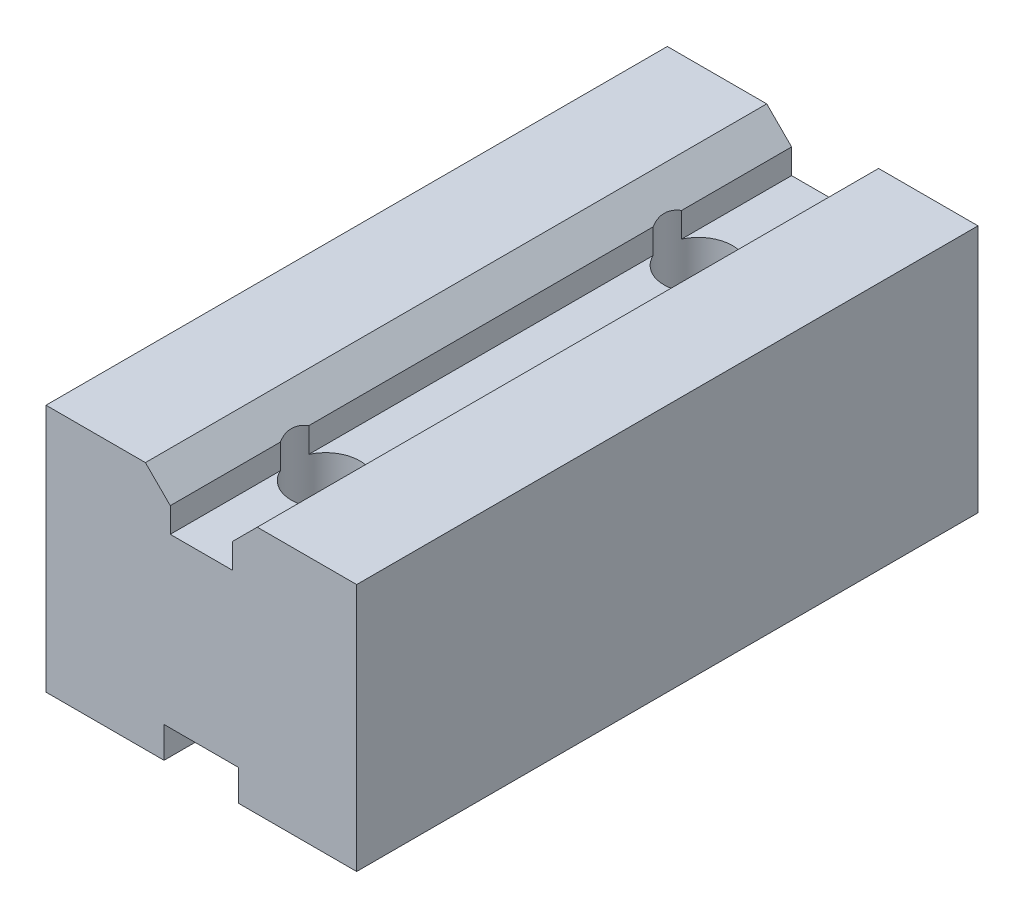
ISO-10303-21;
HEADER;
FILE_DESCRIPTION(('STEP AP214'),'2;1');
FILE_NAME('part.step','',(''),(''),'','','');
FILE_SCHEMA(('AUTOMOTIVE_DESIGN { 1 0 10303 214 1 1 1 1 }'));
ENDSEC;
DATA;
#1=APPLICATION_CONTEXT('core data for automotive mechanical design processes');
#2=APPLICATION_PROTOCOL_DEFINITION('international standard','automotive_design',2000,#1);
#3=PRODUCT_CONTEXT('',#1,'mechanical');
#4=PRODUCT('Part','Part','',(#3));
#5=PRODUCT_RELATED_PRODUCT_CATEGORY('part','',(#4));
#6=PRODUCT_DEFINITION_FORMATION('','',#4);
#7=PRODUCT_DEFINITION_CONTEXT('part definition',#1,'design');
#8=PRODUCT_DEFINITION('design','',#6,#7);
#9=PRODUCT_DEFINITION_SHAPE('','',#8);
#10=(LENGTH_UNIT() NAMED_UNIT(*) SI_UNIT(.MILLI.,.METRE.));
#11=(NAMED_UNIT(*) PLANE_ANGLE_UNIT() SI_UNIT($,.RADIAN.));
#12=(NAMED_UNIT(*) SI_UNIT($,.STERADIAN.) SOLID_ANGLE_UNIT());
#13=UNCERTAINTY_MEASURE_WITH_UNIT(LENGTH_MEASURE(1.E-05),#10,'distance_accuracy_value','');
#14=(GEOMETRIC_REPRESENTATION_CONTEXT(3) GLOBAL_UNCERTAINTY_ASSIGNED_CONTEXT((#13)) GLOBAL_UNIT_ASSIGNED_CONTEXT((#10,
#11,#12)) REPRESENTATION_CONTEXT('',''));
#15=CARTESIAN_POINT('',(0.,0.,0.));
#16=DIRECTION('',(0.,0.,1.));
#17=DIRECTION('',(1.,0.,0.));
#18=AXIS2_PLACEMENT_3D('',#15,#16,#17);
#19=CARTESIAN_POINT('',(2.5,4.53219844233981,25.));
#20=DIRECTION('',(1.,0.,0.));
#21=DIRECTION('',(0.,1.,0.));
#22=AXIS2_PLACEMENT_3D('',#19,#20,#21);
#23=PLANE('',#22);
#24=DIRECTION('',(0.,0.,-1.));
#25=VECTOR('',#24,1.);
#26=CARTESIAN_POINT('',(2.5,2.53219844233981,25.));
#27=LINE('',#26,#25);
#28=CARTESIAN_POINT('',(2.5,2.53219844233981,-16.145643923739));
#29=VERTEX_POINT('',#28);
#30=CARTESIAN_POINT('',(2.5,2.53219844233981,-25.));
#31=VERTEX_POINT('',#30);
#32=EDGE_CURVE('E352',#29,#31,#27,.T.);
#33=ORIENTED_EDGE('',*,*,#32,.F.);
#34=DIRECTION('',(0.,1.,0.));
#35=VECTOR('',#34,1.);
#36=CARTESIAN_POINT('',(2.5,6.53219844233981,-16.145643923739));
#37=LINE('',#36,#35);
#38=CARTESIAN_POINT('',(2.5,4.53219844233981,-16.145643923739));
#39=VERTEX_POINT('',#38);
#40=EDGE_CURVE('E199',#29,#39,#37,.T.);
#41=ORIENTED_EDGE('',*,*,#40,.T.);
#42=DIRECTION('',(0.,0.,-1.));
#43=VECTOR('',#42,1.);
#44=CARTESIAN_POINT('',(2.5,4.53219844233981,25.));
#45=LINE('',#44,#43);
#46=CARTESIAN_POINT('',(2.5,4.53219844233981,-25.));
#47=VERTEX_POINT('',#46);
#48=EDGE_CURVE('E350',#39,#47,#45,.T.);
#49=ORIENTED_EDGE('',*,*,#48,.T.);
#50=DIRECTION('',(0.,-1.,0.));
#51=VECTOR('',#50,1.);
#52=CARTESIAN_POINT('',(2.5,4.53219844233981,-25.));
#53=LINE('',#52,#51);
#54=EDGE_CURVE('E298',#47,#31,#53,.T.);
#55=ORIENTED_EDGE('',*,*,#54,.T.);
#56=EDGE_LOOP('',(#33,#41,#49,#55));
#57=FACE_BOUND('',#56,.T.);
#58=ADVANCED_FACE('F39',(#57),#23,.F.);
#59=CARTESIAN_POINT('',(-2.5,2.53219844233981,25.));
#60=DIRECTION('',(0.,-1.,0.));
#61=DIRECTION('',(0.,0.,-1.));
#62=AXIS2_PLACEMENT_3D('',#59,#60,#61);
#63=PLANE('',#62);
#64=CARTESIAN_POINT('',(2.5,2.53219844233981,13.854356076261));
#65=VERTEX_POINT('',#64);
#66=CARTESIAN_POINT('',(2.5,2.53219844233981,-13.854356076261));
#67=VERTEX_POINT('',#66);
#68=EDGE_CURVE('E351',#65,#67,#27,.T.);
#69=ORIENTED_EDGE('',*,*,#68,.T.);
#70=CARTESIAN_POINT('',(0.,2.53219844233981,-15.));
#71=DIRECTION('',(0.,-1.,0.));
#72=DIRECTION('',(0.,0.,-1.));
#73=AXIS2_PLACEMENT_3D('',#70,#71,#72);
#74=CIRCLE('',#73,2.75);
#75=CARTESIAN_POINT('',(-2.5,2.53219844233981,-13.854356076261));
#76=VERTEX_POINT('',#75);
#77=EDGE_CURVE('E397',#67,#76,#74,.T.);
#78=ORIENTED_EDGE('',*,*,#77,.T.);
#79=DIRECTION('',(0.,0.,-1.));
#80=VECTOR('',#79,1.);
#81=CARTESIAN_POINT('',(-2.5,2.53219844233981,25.));
#82=LINE('',#81,#80);
#83=CARTESIAN_POINT('',(-2.5,2.53219844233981,13.854356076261));
#84=VERTEX_POINT('',#83);
#85=EDGE_CURVE('E198',#84,#76,#82,.T.);
#86=ORIENTED_EDGE('',*,*,#85,.F.);
#87=CARTESIAN_POINT('',(0.,2.53219844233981,15.));
#88=DIRECTION('',(0.,-1.,0.));
#89=DIRECTION('',(0.,0.,-1.));
#90=AXIS2_PLACEMENT_3D('',#87,#88,#89);
#91=CIRCLE('',#90,2.75);
#92=EDGE_CURVE('E239',#84,#65,#91,.T.);
#93=ORIENTED_EDGE('',*,*,#92,.T.);
#94=EDGE_LOOP('',(#69,#78,#86,#93));
#95=FACE_BOUND('',#94,.T.);
#96=ADVANCED_FACE('F581',(#95),#63,.F.);
#97=CARTESIAN_POINT('',(-2.5,4.53219844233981,25.));
#98=DIRECTION('',(-1.,0.,0.));
#99=DIRECTION('',(0.,-1.,0.));
#100=AXIS2_PLACEMENT_3D('',#97,#98,#99);
#101=PLANE('',#100);
#102=ORIENTED_EDGE('',*,*,#85,.T.);
#103=DIRECTION('',(0.,1.,0.));
#104=VECTOR('',#103,1.);
#105=CARTESIAN_POINT('',(-2.5,6.53219844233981,-13.854356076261));
#106=LINE('',#105,#104);
#107=CARTESIAN_POINT('',(-2.5,4.53219844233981,-13.854356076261));
#108=VERTEX_POINT('',#107);
#109=EDGE_CURVE('E186',#76,#108,#106,.T.);
#110=ORIENTED_EDGE('',*,*,#109,.T.);
#111=DIRECTION('',(0.,0.,-1.));
#112=VECTOR('',#111,1.);
#113=CARTESIAN_POINT('',(-2.5,4.53219844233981,25.));
#114=LINE('',#113,#112);
#115=CARTESIAN_POINT('',(-2.5,4.53219844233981,13.854356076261));
#116=VERTEX_POINT('',#115);
#117=EDGE_CURVE('E196',#116,#108,#114,.T.);
#118=ORIENTED_EDGE('',*,*,#117,.F.);
#119=DIRECTION('',(0.,1.,0.));
#120=VECTOR('',#119,1.);
#121=CARTESIAN_POINT('',(-2.5,6.53219844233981,13.854356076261));
#122=LINE('',#121,#120);
#123=EDGE_CURVE('E246',#116,#84,#122,.F.);
#124=ORIENTED_EDGE('',*,*,#123,.T.);
#125=EDGE_LOOP('',(#102,#110,#118,#124));
#126=FACE_BOUND('',#125,.T.);
#127=ADVANCED_FACE('F194',(#126),#101,.F.);
#128=CARTESIAN_POINT('',(-2.5,2.53219844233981,25.));
#129=VERTEX_POINT('',#128);
#130=CARTESIAN_POINT('',(-2.5,2.53219844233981,16.145643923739));
#131=VERTEX_POINT('',#130);
#132=EDGE_CURVE('E216',#129,#131,#82,.T.);
#133=ORIENTED_EDGE('',*,*,#132,.T.);
#134=DIRECTION('',(0.,1.,0.));
#135=VECTOR('',#134,1.);
#136=CARTESIAN_POINT('',(-2.5,6.53219844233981,16.145643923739));
#137=LINE('',#136,#135);
#138=CARTESIAN_POINT('',(-2.5,4.53219844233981,16.145643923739));
#139=VERTEX_POINT('',#138);
#140=EDGE_CURVE('E238',#131,#139,#137,.T.);
#141=ORIENTED_EDGE('',*,*,#140,.T.);
#142=CARTESIAN_POINT('',(-2.5,4.53219844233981,25.));
#143=VERTEX_POINT('',#142);
#144=EDGE_CURVE('E206',#143,#139,#114,.T.);
#145=ORIENTED_EDGE('',*,*,#144,.F.);
#146=DIRECTION('',(0.,1.,0.));
#147=VECTOR('',#146,1.);
#148=CARTESIAN_POINT('',(-2.5,4.53219844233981,25.));
#149=LINE('',#148,#147);
#150=EDGE_CURVE('E334',#129,#143,#149,.T.);
#151=ORIENTED_EDGE('',*,*,#150,.F.);
#152=EDGE_LOOP('',(#133,#141,#145,#151));
#153=FACE_BOUND('',#152,.T.);
#154=ADVANCED_FACE('F425',(#153),#101,.F.);
#155=CARTESIAN_POINT('',(2.5,2.53219844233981,25.));
#156=VERTEX_POINT('',#155);
#157=CARTESIAN_POINT('',(2.5,2.53219844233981,16.145643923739));
#158=VERTEX_POINT('',#157);
#159=EDGE_CURVE('E346',#156,#158,#27,.T.);
#160=ORIENTED_EDGE('',*,*,#159,.T.);
#161=EDGE_CURVE('E61',#158,#131,#91,.T.);
#162=ORIENTED_EDGE('',*,*,#161,.T.);
#163=ORIENTED_EDGE('',*,*,#132,.F.);
#164=DIRECTION('',(-1.,0.,0.));
#165=VECTOR('',#164,1.);
#166=CARTESIAN_POINT('',(-2.5,2.53219844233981,25.));
#167=LINE('',#166,#165);
#168=EDGE_CURVE('E338',#156,#129,#167,.T.);
#169=ORIENTED_EDGE('',*,*,#168,.F.);
#170=EDGE_LOOP('',(#160,#162,#163,#169));
#171=FACE_BOUND('',#170,.T.);
#172=ADVANCED_FACE('F436',(#171),#63,.F.);
#173=CARTESIAN_POINT('',(2.5,4.53219844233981,13.854356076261));
#174=VERTEX_POINT('',#173);
#175=CARTESIAN_POINT('',(2.5,4.53219844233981,-13.854356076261));
#176=VERTEX_POINT('',#175);
#177=EDGE_CURVE('E359',#174,#176,#45,.T.);
#178=ORIENTED_EDGE('',*,*,#177,.T.);
#179=DIRECTION('',(0.,1.,0.));
#180=VECTOR('',#179,1.);
#181=CARTESIAN_POINT('',(2.5,6.53219844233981,-13.854356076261));
#182=LINE('',#181,#180);
#183=EDGE_CURVE('E401',#176,#67,#182,.F.);
#184=ORIENTED_EDGE('',*,*,#183,.T.);
#185=ORIENTED_EDGE('',*,*,#68,.F.);
#186=DIRECTION('',(0.,1.,0.));
#187=VECTOR('',#186,1.);
#188=CARTESIAN_POINT('',(2.5,6.53219844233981,13.854356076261));
#189=LINE('',#188,#187);
#190=EDGE_CURVE('E47',#65,#174,#189,.T.);
#191=ORIENTED_EDGE('',*,*,#190,.T.);
#192=EDGE_LOOP('',(#178,#184,#185,#191));
#193=FACE_BOUND('',#192,.T.);
#194=ADVANCED_FACE('F478',(#193),#23,.F.);
#195=CARTESIAN_POINT('',(12.5,-13.4678015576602,25.));
#196=DIRECTION('',(0.,1.,0.));
#197=DIRECTION('',(0.,0.,1.));
#198=AXIS2_PLACEMENT_3D('',#195,#196,#197);
#199=PLANE('',#198);
#200=DIRECTION('',(1.,0.,0.));
#201=VECTOR('',#200,1.);
#202=CARTESIAN_POINT('',(12.5,-13.4678015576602,-25.));
#203=LINE('',#202,#201);
#204=CARTESIAN_POINT('',(-12.5,-13.4678015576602,-25.));
#205=VERTEX_POINT('',#204);
#206=CARTESIAN_POINT('',(-3.,-13.4678015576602,-25.));
#207=VERTEX_POINT('',#206);
#208=EDGE_CURVE('E272',#205,#207,#203,.T.);
#209=ORIENTED_EDGE('',*,*,#208,.T.);
#210=DIRECTION('',(0.,0.,1.));
#211=VECTOR('',#210,1.);
#212=CARTESIAN_POINT('',(-3.,-13.4678015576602,-25.));
#213=LINE('',#212,#211);
#214=CARTESIAN_POINT('',(-3.,-13.4678015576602,25.));
#215=VERTEX_POINT('',#214);
#216=EDGE_CURVE('E771',#207,#215,#213,.T.);
#217=ORIENTED_EDGE('',*,*,#216,.T.);
#218=DIRECTION('',(1.,0.,0.));
#219=VECTOR('',#218,1.);
#220=CARTESIAN_POINT('',(12.5,-13.4678015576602,25.));
#221=LINE('',#220,#219);
#222=CARTESIAN_POINT('',(-12.5,-13.4678015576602,25.));
#223=VERTEX_POINT('',#222);
#224=EDGE_CURVE('E458',#223,#215,#221,.T.);
#225=ORIENTED_EDGE('',*,*,#224,.F.);
#226=DIRECTION('',(0.,0.,-1.));
#227=VECTOR('',#226,1.);
#228=CARTESIAN_POINT('',(-12.5,-13.4678015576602,25.));
#229=LINE('',#228,#227);
#230=EDGE_CURVE('E368',#223,#205,#229,.T.);
#231=ORIENTED_EDGE('',*,*,#230,.T.);
#232=EDGE_LOOP('',(#209,#217,#225,#231));
#233=FACE_BOUND('',#232,.T.);
#234=ADVANCED_FACE('F617',(#233),#199,.F.);
#235=CARTESIAN_POINT('',(-12.5,-13.4678015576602,25.));
#236=DIRECTION('',(1.,0.,0.));
#237=DIRECTION('',(0.,1.,0.));
#238=AXIS2_PLACEMENT_3D('',#235,#236,#237);
#239=PLANE('',#238);
#240=DIRECTION('',(0.,-1.,0.));
#241=VECTOR('',#240,1.);
#242=CARTESIAN_POINT('',(-12.5,-13.4678015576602,-25.));
#243=LINE('',#242,#241);
#244=CARTESIAN_POINT('',(-12.5,6.53219844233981,-25.));
#245=VERTEX_POINT('',#244);
#246=EDGE_CURVE('E279',#245,#205,#243,.T.);
#247=ORIENTED_EDGE('',*,*,#246,.T.);
#248=ORIENTED_EDGE('',*,*,#230,.F.);
#249=DIRECTION('',(0.,-1.,0.));
#250=VECTOR('',#249,1.);
#251=CARTESIAN_POINT('',(-12.5,-13.4678015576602,25.));
#252=LINE('',#251,#250);
#253=CARTESIAN_POINT('',(-12.5,6.53219844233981,25.));
#254=VERTEX_POINT('',#253);
#255=EDGE_CURVE('E320',#254,#223,#252,.T.);
#256=ORIENTED_EDGE('',*,*,#255,.F.);
#257=DIRECTION('',(0.,0.,-1.));
#258=VECTOR('',#257,1.);
#259=CARTESIAN_POINT('',(-12.5,6.53219844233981,25.));
#260=LINE('',#259,#258);
#261=EDGE_CURVE('E321',#254,#245,#260,.T.);
#262=ORIENTED_EDGE('',*,*,#261,.T.);
#263=EDGE_LOOP('',(#247,#248,#256,#262));
#264=FACE_BOUND('',#263,.T.);
#265=ADVANCED_FACE('F41',(#264),#239,.F.);
#266=CARTESIAN_POINT('',(3.,-13.4678015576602,25.));
#267=VERTEX_POINT('',#266);
#268=CARTESIAN_POINT('',(12.5,-13.4678015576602,25.));
#269=VERTEX_POINT('',#268);
#270=EDGE_CURVE('E456',#267,#269,#221,.T.);
#271=ORIENTED_EDGE('',*,*,#270,.F.);
#272=DIRECTION('',(0.,0.,1.));
#273=VECTOR('',#272,1.);
#274=CARTESIAN_POINT('',(3.,-13.4678015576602,-25.));
#275=LINE('',#274,#273);
#276=CARTESIAN_POINT('',(3.,-13.4678015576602,-25.));
#277=VERTEX_POINT('',#276);
#278=EDGE_CURVE('E461',#277,#267,#275,.T.);
#279=ORIENTED_EDGE('',*,*,#278,.F.);
#280=CARTESIAN_POINT('',(12.5,-13.4678015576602,-25.));
#281=VERTEX_POINT('',#280);
#282=EDGE_CURVE('E278',#277,#281,#203,.T.);
#283=ORIENTED_EDGE('',*,*,#282,.T.);
#284=DIRECTION('',(0.,0.,-1.));
#285=VECTOR('',#284,1.);
#286=CARTESIAN_POINT('',(12.5,-13.4678015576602,25.));
#287=LINE('',#286,#285);
#288=EDGE_CURVE('E365',#269,#281,#287,.T.);
#289=ORIENTED_EDGE('',*,*,#288,.F.);
#290=EDGE_LOOP('',(#271,#279,#283,#289));
#291=FACE_BOUND('',#290,.T.);
#292=ADVANCED_FACE('F638',(#291),#199,.F.);
#293=CARTESIAN_POINT('',(12.5,-13.4678015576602,25.));
#294=DIRECTION('',(-1.,0.,0.));
#295=DIRECTION('',(0.,-1.,0.));
#296=AXIS2_PLACEMENT_3D('',#293,#294,#295);
#297=PLANE('',#296);
#298=DIRECTION('',(0.,1.,0.));
#299=VECTOR('',#298,1.);
#300=CARTESIAN_POINT('',(12.5,-13.4678015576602,-25.));
#301=LINE('',#300,#299);
#302=CARTESIAN_POINT('',(12.5,6.53219844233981,-25.));
#303=VERTEX_POINT('',#302);
#304=EDGE_CURVE('E277',#281,#303,#301,.T.);
#305=ORIENTED_EDGE('',*,*,#304,.T.);
#306=DIRECTION('',(0.,0.,-1.));
#307=VECTOR('',#306,1.);
#308=CARTESIAN_POINT('',(12.5,6.53219844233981,25.));
#309=LINE('',#308,#307);
#310=CARTESIAN_POINT('',(12.5,6.53219844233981,25.));
#311=VERTEX_POINT('',#310);
#312=EDGE_CURVE('E362',#311,#303,#309,.T.);
#313=ORIENTED_EDGE('',*,*,#312,.F.);
#314=DIRECTION('',(0.,1.,0.));
#315=VECTOR('',#314,1.);
#316=CARTESIAN_POINT('',(12.5,-13.4678015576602,25.));
#317=LINE('',#316,#315);
#318=EDGE_CURVE('E464',#269,#311,#317,.T.);
#319=ORIENTED_EDGE('',*,*,#318,.F.);
#320=ORIENTED_EDGE('',*,*,#288,.T.);
#321=EDGE_LOOP('',(#305,#313,#319,#320));
#322=FACE_BOUND('',#321,.T.);
#323=ADVANCED_FACE('F490',(#322),#297,.F.);
#324=CARTESIAN_POINT('',(12.5,6.53219844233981,25.));
#325=DIRECTION('',(0.,-1.,0.));
#326=DIRECTION('',(0.,0.,-1.));
#327=AXIS2_PLACEMENT_3D('',#324,#325,#326);
#328=PLANE('',#327);
#329=DIRECTION('',(-1.,0.,0.));
#330=VECTOR('',#329,1.);
#331=CARTESIAN_POINT('',(12.5,6.53219844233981,-25.));
#332=LINE('',#331,#330);
#333=CARTESIAN_POINT('',(4.50000000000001,6.53219844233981,-25.));
#334=VERTEX_POINT('',#333);
#335=EDGE_CURVE('E290',#303,#334,#332,.T.);
#336=ORIENTED_EDGE('',*,*,#335,.T.);
#337=DIRECTION('',(0.,0.,-1.));
#338=VECTOR('',#337,1.);
#339=CARTESIAN_POINT('',(4.50000000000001,6.53219844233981,25.));
#340=LINE('',#339,#338);
#341=CARTESIAN_POINT('',(4.50000000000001,6.53219844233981,25.));
#342=VERTEX_POINT('',#341);
#343=EDGE_CURVE('E358',#342,#334,#340,.T.);
#344=ORIENTED_EDGE('',*,*,#343,.F.);
#345=DIRECTION('',(-1.,0.,0.));
#346=VECTOR('',#345,1.);
#347=CARTESIAN_POINT('',(12.5,6.53219844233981,25.));
#348=LINE('',#347,#346);
#349=EDGE_CURVE('E466',#311,#342,#348,.T.);
#350=ORIENTED_EDGE('',*,*,#349,.F.);
#351=ORIENTED_EDGE('',*,*,#312,.T.);
#352=EDGE_LOOP('',(#336,#344,#350,#351));
#353=FACE_BOUND('',#352,.T.);
#354=ADVANCED_FACE('F486',(#353),#328,.F.);
#355=CARTESIAN_POINT('',(4.50000000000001,6.53219844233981,25.));
#356=DIRECTION('',(0.707106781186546,-0.707106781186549,0.));
#357=DIRECTION('',(0.707106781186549,0.707106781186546,0.));
#358=AXIS2_PLACEMENT_3D('',#355,#356,#357);
#359=PLANE('',#358);
#360=ORIENTED_EDGE('',*,*,#48,.F.);
#361=CARTESIAN_POINT('',(0.,2.03219844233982,-15.));
#362=DIRECTION('',(0.707106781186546,-0.707106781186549,0.));
#363=DIRECTION('',(0.707106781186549,0.707106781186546,0.));
#364=AXIS2_PLACEMENT_3D('',#361,#362,#363);
#365=ELLIPSE('',#364,3.889087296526,2.75);
#366=EDGE_CURVE('E403',#39,#176,#365,.T.);
#367=ORIENTED_EDGE('',*,*,#366,.T.);
#368=ORIENTED_EDGE('',*,*,#177,.F.);
#369=CARTESIAN_POINT('',(0.,2.03219844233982,15.));
#370=DIRECTION('',(0.707106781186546,-0.707106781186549,0.));
#371=DIRECTION('',(0.707106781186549,0.707106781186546,0.));
#372=AXIS2_PLACEMENT_3D('',#369,#370,#371);
#373=ELLIPSE('',#372,3.889087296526,2.75);
#374=CARTESIAN_POINT('',(2.5,4.53219844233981,16.145643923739));
#375=VERTEX_POINT('',#374);
#376=EDGE_CURVE('E242',#174,#375,#373,.T.);
#377=ORIENTED_EDGE('',*,*,#376,.T.);
#378=CARTESIAN_POINT('',(2.5,4.53219844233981,25.));
#379=VERTEX_POINT('',#378);
#380=EDGE_CURVE('E353',#379,#375,#45,.T.);
#381=ORIENTED_EDGE('',*,*,#380,.F.);
#382=DIRECTION('',(-0.707106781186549,-0.707106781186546,0.));
#383=VECTOR('',#382,1.);
#384=CARTESIAN_POINT('',(4.50000000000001,6.53219844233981,25.));
#385=LINE('',#384,#383);
#386=EDGE_CURVE('E467',#342,#379,#385,.T.);
#387=ORIENTED_EDGE('',*,*,#386,.F.);
#388=ORIENTED_EDGE('',*,*,#343,.T.);
#389=DIRECTION('',(-0.707106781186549,-0.707106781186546,0.));
#390=VECTOR('',#389,1.);
#391=CARTESIAN_POINT('',(4.50000000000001,6.53219844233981,-25.));
#392=LINE('',#391,#390);
#393=EDGE_CURVE('E293',#334,#47,#392,.T.);
#394=ORIENTED_EDGE('',*,*,#393,.T.);
#395=EDGE_LOOP('',(#360,#367,#368,#377,#381,#387,#388,#394));
#396=FACE_BOUND('',#395,.T.);
#397=ADVANCED_FACE('F472',(#396),#359,.F.);
#398=ORIENTED_EDGE('',*,*,#380,.T.);
#399=DIRECTION('',(0.,1.,0.));
#400=VECTOR('',#399,1.);
#401=CARTESIAN_POINT('',(2.5,6.53219844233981,16.145643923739));
#402=LINE('',#401,#400);
#403=EDGE_CURVE('E371',#375,#158,#402,.F.);
#404=ORIENTED_EDGE('',*,*,#403,.T.);
#405=ORIENTED_EDGE('',*,*,#159,.F.);
#406=DIRECTION('',(0.,-1.,0.));
#407=VECTOR('',#406,1.);
#408=CARTESIAN_POINT('',(2.5,4.53219844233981,25.));
#409=LINE('',#408,#407);
#410=EDGE_CURVE('E342',#379,#156,#409,.T.);
#411=ORIENTED_EDGE('',*,*,#410,.F.);
#412=EDGE_LOOP('',(#398,#404,#405,#411));
#413=FACE_BOUND('',#412,.T.);
#414=ADVANCED_FACE('F474',(#413),#23,.F.);
#415=CARTESIAN_POINT('',(-2.5,2.53219844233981,-16.145643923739));
#416=VERTEX_POINT('',#415);
#417=CARTESIAN_POINT('',(-2.5,2.53219844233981,-25.));
#418=VERTEX_POINT('',#417);
#419=EDGE_CURVE('E209',#416,#418,#82,.T.);
#420=ORIENTED_EDGE('',*,*,#419,.F.);
#421=EDGE_CURVE('E200',#416,#29,#74,.T.);
#422=ORIENTED_EDGE('',*,*,#421,.T.);
#423=ORIENTED_EDGE('',*,*,#32,.T.);
#424=DIRECTION('',(-1.,0.,0.));
#425=VECTOR('',#424,1.);
#426=CARTESIAN_POINT('',(-2.5,2.53219844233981,-25.));
#427=LINE('',#426,#425);
#428=EDGE_CURVE('E303',#31,#418,#427,.T.);
#429=ORIENTED_EDGE('',*,*,#428,.T.);
#430=EDGE_LOOP('',(#420,#422,#423,#429));
#431=FACE_BOUND('',#430,.T.);
#432=ADVANCED_FACE('F445',(#431),#63,.F.);
#433=CARTESIAN_POINT('',(-2.5,4.53219844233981,-16.145643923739));
#434=VERTEX_POINT('',#433);
#435=CARTESIAN_POINT('',(-2.5,4.53219844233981,-25.));
#436=VERTEX_POINT('',#435);
#437=EDGE_CURVE('E207',#434,#436,#114,.T.);
#438=ORIENTED_EDGE('',*,*,#437,.F.);
#439=DIRECTION('',(0.,1.,0.));
#440=VECTOR('',#439,1.);
#441=CARTESIAN_POINT('',(-2.5,6.53219844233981,-16.145643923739));
#442=LINE('',#441,#440);
#443=EDGE_CURVE('E54',#434,#416,#442,.F.);
#444=ORIENTED_EDGE('',*,*,#443,.T.);
#445=ORIENTED_EDGE('',*,*,#419,.T.);
#446=DIRECTION('',(0.,1.,0.));
#447=VECTOR('',#446,1.);
#448=CARTESIAN_POINT('',(-2.5,4.53219844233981,-25.));
#449=LINE('',#448,#447);
#450=EDGE_CURVE('E309',#418,#436,#449,.T.);
#451=ORIENTED_EDGE('',*,*,#450,.T.);
#452=EDGE_LOOP('',(#438,#444,#445,#451));
#453=FACE_BOUND('',#452,.T.);
#454=ADVANCED_FACE('F440',(#453),#101,.F.);
#455=CARTESIAN_POINT('',(-4.50000000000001,6.53219844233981,25.));
#456=DIRECTION('',(-0.707106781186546,-0.707106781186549,0.));
#457=DIRECTION('',(0.707106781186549,-0.707106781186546,0.));
#458=AXIS2_PLACEMENT_3D('',#455,#456,#457);
#459=PLANE('',#458);
#460=ORIENTED_EDGE('',*,*,#117,.T.);
#461=CARTESIAN_POINT('',(0.,2.03219844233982,-15.));
#462=DIRECTION('',(-0.707106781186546,-0.707106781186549,0.));
#463=DIRECTION('',(-0.707106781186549,0.707106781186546,0.));
#464=AXIS2_PLACEMENT_3D('',#461,#462,#463);
#465=ELLIPSE('',#464,3.889087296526,2.75);
#466=EDGE_CURVE('E12',#108,#434,#465,.T.);
#467=ORIENTED_EDGE('',*,*,#466,.T.);
#468=ORIENTED_EDGE('',*,*,#437,.T.);
#469=DIRECTION('',(-0.707106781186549,0.707106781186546,0.));
#470=VECTOR('',#469,1.);
#471=CARTESIAN_POINT('',(-4.50000000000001,6.53219844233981,-25.));
#472=LINE('',#471,#470);
#473=CARTESIAN_POINT('',(-4.50000000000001,6.53219844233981,-25.));
#474=VERTEX_POINT('',#473);
#475=EDGE_CURVE('E313',#436,#474,#472,.T.);
#476=ORIENTED_EDGE('',*,*,#475,.T.);
#477=DIRECTION('',(0.,0.,-1.));
#478=VECTOR('',#477,1.);
#479=CARTESIAN_POINT('',(-4.50000000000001,6.53219844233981,25.));
#480=LINE('',#479,#478);
#481=CARTESIAN_POINT('',(-4.50000000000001,6.53219844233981,25.));
#482=VERTEX_POINT('',#481);
#483=EDGE_CURVE('E211',#482,#474,#480,.T.);
#484=ORIENTED_EDGE('',*,*,#483,.F.);
#485=DIRECTION('',(-0.707106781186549,0.707106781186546,0.));
#486=VECTOR('',#485,1.);
#487=CARTESIAN_POINT('',(-4.50000000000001,6.53219844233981,25.));
#488=LINE('',#487,#486);
#489=EDGE_CURVE('E330',#143,#482,#488,.T.);
#490=ORIENTED_EDGE('',*,*,#489,.F.);
#491=ORIENTED_EDGE('',*,*,#144,.T.);
#492=CARTESIAN_POINT('',(0.,2.03219844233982,15.));
#493=DIRECTION('',(-0.707106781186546,-0.707106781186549,0.));
#494=DIRECTION('',(-0.707106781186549,0.707106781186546,0.));
#495=AXIS2_PLACEMENT_3D('',#492,#493,#494);
#496=ELLIPSE('',#495,3.889087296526,2.75);
#497=EDGE_CURVE('E205',#139,#116,#496,.T.);
#498=ORIENTED_EDGE('',*,*,#497,.T.);
#499=EDGE_LOOP('',(#460,#467,#468,#476,#484,#490,#491,#498));
#500=FACE_BOUND('',#499,.T.);
#501=ADVANCED_FACE('F203',(#500),#459,.F.);
#502=CARTESIAN_POINT('',(-12.5,6.53219844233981,25.));
#503=DIRECTION('',(0.,-1.,0.));
#504=DIRECTION('',(0.,0.,-1.));
#505=AXIS2_PLACEMENT_3D('',#502,#503,#504);
#506=PLANE('',#505);
#507=DIRECTION('',(-1.,0.,0.));
#508=VECTOR('',#507,1.);
#509=CARTESIAN_POINT('',(-12.5,6.53219844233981,-25.));
#510=LINE('',#509,#508);
#511=EDGE_CURVE('E317',#474,#245,#510,.T.);
#512=ORIENTED_EDGE('',*,*,#511,.T.);
#513=ORIENTED_EDGE('',*,*,#261,.F.);
#514=DIRECTION('',(-1.,0.,0.));
#515=VECTOR('',#514,1.);
#516=CARTESIAN_POINT('',(-12.5,6.53219844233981,25.));
#517=LINE('',#516,#515);
#518=EDGE_CURVE('E323',#482,#254,#517,.T.);
#519=ORIENTED_EDGE('',*,*,#518,.F.);
#520=ORIENTED_EDGE('',*,*,#483,.T.);
#521=EDGE_LOOP('',(#512,#513,#519,#520));
#522=FACE_BOUND('',#521,.T.);
#523=ADVANCED_FACE('F454',(#522),#506,.F.);
#524=CARTESIAN_POINT('',(0.,0.,25.));
#525=DIRECTION('',(0.,0.,-1.));
#526=DIRECTION('',(-1.,0.,0.));
#527=AXIS2_PLACEMENT_3D('',#524,#525,#526);
#528=PLANE('',#527);
#529=ORIENTED_EDGE('',*,*,#224,.T.);
#530=DIRECTION('',(0.,-1.,0.));
#531=VECTOR('',#530,1.);
#532=CARTESIAN_POINT('',(-3.,-13.4678015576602,25.));
#533=LINE('',#532,#531);
#534=CARTESIAN_POINT('',(-3.,-10.9678015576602,25.));
#535=VERTEX_POINT('',#534);
#536=EDGE_CURVE('E254',#535,#215,#533,.T.);
#537=ORIENTED_EDGE('',*,*,#536,.F.);
#538=DIRECTION('',(-1.,0.,0.));
#539=VECTOR('',#538,1.);
#540=CARTESIAN_POINT('',(-3.,-10.9678015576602,25.));
#541=LINE('',#540,#539);
#542=CARTESIAN_POINT('',(3.,-10.9678015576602,25.));
#543=VERTEX_POINT('',#542);
#544=EDGE_CURVE('E757',#543,#535,#541,.T.);
#545=ORIENTED_EDGE('',*,*,#544,.F.);
#546=DIRECTION('',(0.,1.,0.));
#547=VECTOR('',#546,1.);
#548=CARTESIAN_POINT('',(3.,-10.9678015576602,25.));
#549=LINE('',#548,#547);
#550=EDGE_CURVE('E247',#267,#543,#549,.T.);
#551=ORIENTED_EDGE('',*,*,#550,.F.);
#552=ORIENTED_EDGE('',*,*,#270,.T.);
#553=ORIENTED_EDGE('',*,*,#318,.T.);
#554=ORIENTED_EDGE('',*,*,#349,.T.);
#555=ORIENTED_EDGE('',*,*,#386,.T.);
#556=ORIENTED_EDGE('',*,*,#410,.T.);
#557=ORIENTED_EDGE('',*,*,#168,.T.);
#558=ORIENTED_EDGE('',*,*,#150,.T.);
#559=ORIENTED_EDGE('',*,*,#489,.T.);
#560=ORIENTED_EDGE('',*,*,#518,.T.);
#561=ORIENTED_EDGE('',*,*,#255,.T.);
#562=EDGE_LOOP('',(#529,#537,#545,#551,#552,#553,#554,#555,#556,#557,#558,#559,#560,#561));
#563=FACE_BOUND('',#562,.T.);
#564=ADVANCED_FACE('F431',(#563),#528,.F.);
#565=CARTESIAN_POINT('',(0.,0.,-25.));
#566=DIRECTION('',(0.,0.,-1.));
#567=DIRECTION('',(-1.,0.,0.));
#568=AXIS2_PLACEMENT_3D('',#565,#566,#567);
#569=PLANE('',#568);
#570=DIRECTION('',(0.,-1.,0.));
#571=VECTOR('',#570,1.);
#572=CARTESIAN_POINT('',(-3.,-13.4678015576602,-25.));
#573=LINE('',#572,#571);
#574=CARTESIAN_POINT('',(-3.,-10.9678015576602,-25.));
#575=VERTEX_POINT('',#574);
#576=EDGE_CURVE('E259',#575,#207,#573,.T.);
#577=ORIENTED_EDGE('',*,*,#576,.T.);
#578=ORIENTED_EDGE('',*,*,#208,.F.);
#579=ORIENTED_EDGE('',*,*,#246,.F.);
#580=ORIENTED_EDGE('',*,*,#511,.F.);
#581=ORIENTED_EDGE('',*,*,#475,.F.);
#582=ORIENTED_EDGE('',*,*,#450,.F.);
#583=ORIENTED_EDGE('',*,*,#428,.F.);
#584=ORIENTED_EDGE('',*,*,#54,.F.);
#585=ORIENTED_EDGE('',*,*,#393,.F.);
#586=ORIENTED_EDGE('',*,*,#335,.F.);
#587=ORIENTED_EDGE('',*,*,#304,.F.);
#588=ORIENTED_EDGE('',*,*,#282,.F.);
#589=DIRECTION('',(0.,1.,0.));
#590=VECTOR('',#589,1.);
#591=CARTESIAN_POINT('',(3.,-10.9678015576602,-25.));
#592=LINE('',#591,#590);
#593=CARTESIAN_POINT('',(3.,-10.9678015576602,-25.));
#594=VERTEX_POINT('',#593);
#595=EDGE_CURVE('E248',#277,#594,#592,.T.);
#596=ORIENTED_EDGE('',*,*,#595,.T.);
#597=DIRECTION('',(-1.,0.,0.));
#598=VECTOR('',#597,1.);
#599=CARTESIAN_POINT('',(-3.,-10.9678015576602,-25.));
#600=LINE('',#599,#598);
#601=EDGE_CURVE('E253',#594,#575,#600,.T.);
#602=ORIENTED_EDGE('',*,*,#601,.T.);
#603=EDGE_LOOP('',(#577,#578,#579,#580,#581,#582,#583,#584,#585,#586,#587,#588,#596,#602));
#604=FACE_BOUND('',#603,.T.);
#605=ADVANCED_FACE('F451',(#604),#569,.T.);
#606=CARTESIAN_POINT('',(-3.,-13.4678015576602,-25.));
#607=DIRECTION('',(-1.,0.,0.));
#608=DIRECTION('',(0.,-1.,0.));
#609=AXIS2_PLACEMENT_3D('',#606,#607,#608);
#610=PLANE('',#609);
#611=ORIENTED_EDGE('',*,*,#536,.T.);
#612=ORIENTED_EDGE('',*,*,#216,.F.);
#613=ORIENTED_EDGE('',*,*,#576,.F.);
#614=DIRECTION('',(0.,0.,1.));
#615=VECTOR('',#614,1.);
#616=CARTESIAN_POINT('',(-3.,-10.9678015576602,-25.));
#617=LINE('',#616,#615);
#618=EDGE_CURVE('E759',#575,#535,#617,.T.);
#619=ORIENTED_EDGE('',*,*,#618,.T.);
#620=EDGE_LOOP('',(#611,#612,#613,#619));
#621=FACE_BOUND('',#620,.T.);
#622=ADVANCED_FACE('F503',(#621),#610,.F.);
#623=CARTESIAN_POINT('',(-3.,-10.9678015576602,-25.));
#624=DIRECTION('',(0.,1.,0.));
#625=DIRECTION('',(0.,0.,1.));
#626=AXIS2_PLACEMENT_3D('',#623,#624,#625);
#627=PLANE('',#626);
#628=CARTESIAN_POINT('',(0.,-10.9678015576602,-15.));
#629=DIRECTION('',(0.,1.,0.));
#630=DIRECTION('',(0.,0.,1.));
#631=AXIS2_PLACEMENT_3D('',#628,#629,#630);
#632=CIRCLE('',#631,1.45);
#633=CARTESIAN_POINT('',(0.,-10.9678015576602,-13.55));
#634=VERTEX_POINT('',#633);
#635=EDGE_CURVE('E376',#634,#634,#632,.T.);
#636=ORIENTED_EDGE('',*,*,#635,.T.);
#637=EDGE_LOOP('',(#636));
#638=FACE_BOUND('',#637,.T.);
#639=CARTESIAN_POINT('',(0.,-10.9678015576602,15.));
#640=DIRECTION('',(0.,1.,0.));
#641=DIRECTION('',(0.,0.,1.));
#642=AXIS2_PLACEMENT_3D('',#639,#640,#641);
#643=CIRCLE('',#642,1.45);
#644=CARTESIAN_POINT('',(0.,-10.9678015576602,16.45));
#645=VERTEX_POINT('',#644);
#646=EDGE_CURVE('E233',#645,#645,#643,.T.);
#647=ORIENTED_EDGE('',*,*,#646,.T.);
#648=EDGE_LOOP('',(#647));
#649=FACE_BOUND('',#648,.T.);
#650=ORIENTED_EDGE('',*,*,#544,.T.);
#651=ORIENTED_EDGE('',*,*,#618,.F.);
#652=ORIENTED_EDGE('',*,*,#601,.F.);
#653=DIRECTION('',(0.,0.,1.));
#654=VECTOR('',#653,1.);
#655=CARTESIAN_POINT('',(3.,-10.9678015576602,-25.));
#656=LINE('',#655,#654);
#657=EDGE_CURVE('E762',#594,#543,#656,.T.);
#658=ORIENTED_EDGE('',*,*,#657,.T.);
#659=EDGE_LOOP('',(#650,#651,#652,#658));
#660=FACE_BOUND('',#659,.T.);
#661=ADVANCED_FACE('F499',(#638,#649,#660),#627,.F.);
#662=CARTESIAN_POINT('',(3.,-10.9678015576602,-25.));
#663=DIRECTION('',(1.,0.,0.));
#664=DIRECTION('',(0.,0.,-1.));
#665=AXIS2_PLACEMENT_3D('',#662,#663,#664);
#666=PLANE('',#665);
#667=ORIENTED_EDGE('',*,*,#550,.T.);
#668=ORIENTED_EDGE('',*,*,#657,.F.);
#669=ORIENTED_EDGE('',*,*,#595,.F.);
#670=ORIENTED_EDGE('',*,*,#278,.T.);
#671=EDGE_LOOP('',(#667,#668,#669,#670));
#672=FACE_BOUND('',#671,.T.);
#673=ADVANCED_FACE('F420',(#672),#666,.F.);
#674=CARTESIAN_POINT('',(0.,6.53219844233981,15.));
#675=DIRECTION('',(0.,1.,0.));
#676=DIRECTION('',(0.,0.,1.));
#677=AXIS2_PLACEMENT_3D('',#674,#675,#676);
#678=CYLINDRICAL_SURFACE('',#677,2.75);
#679=CARTESIAN_POINT('',(0.,-3.46780155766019,15.));
#680=DIRECTION('',(0.,1.,0.));
#681=DIRECTION('',(0.,0.,1.));
#682=AXIS2_PLACEMENT_3D('',#679,#680,#681);
#683=CIRCLE('',#682,2.75);
#684=CARTESIAN_POINT('',(0.,-3.46780155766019,17.75));
#685=VERTEX_POINT('',#684);
#686=EDGE_CURVE('E234',#685,#685,#683,.T.);
#687=ORIENTED_EDGE('',*,*,#686,.F.);
#688=EDGE_LOOP('',(#687));
#689=FACE_BOUND('',#688,.T.);
#690=ORIENTED_EDGE('',*,*,#497,.F.);
#691=ORIENTED_EDGE('',*,*,#140,.F.);
#692=ORIENTED_EDGE('',*,*,#161,.F.);
#693=ORIENTED_EDGE('',*,*,#403,.F.);
#694=ORIENTED_EDGE('',*,*,#376,.F.);
#695=ORIENTED_EDGE('',*,*,#190,.F.);
#696=ORIENTED_EDGE('',*,*,#92,.F.);
#697=ORIENTED_EDGE('',*,*,#123,.F.);
#698=EDGE_LOOP('',(#690,#691,#692,#693,#694,#695,#696,#697));
#699=FACE_BOUND('',#698,.T.);
#700=ADVANCED_FACE('F417',(#689,#699),#678,.F.);
#701=CARTESIAN_POINT('',(0.,6.53219844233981,15.));
#702=DIRECTION('',(0.,1.,0.));
#703=DIRECTION('',(0.,0.,1.));
#704=AXIS2_PLACEMENT_3D('',#701,#702,#703);
#705=CYLINDRICAL_SURFACE('',#704,1.45);
#706=CARTESIAN_POINT('',(0.,-3.46780155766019,15.));
#707=DIRECTION('',(0.,1.,0.));
#708=DIRECTION('',(0.,0.,1.));
#709=AXIS2_PLACEMENT_3D('',#706,#707,#708);
#710=CIRCLE('',#709,1.45);
#711=CARTESIAN_POINT('',(0.,-3.46780155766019,16.45));
#712=VERTEX_POINT('',#711);
#713=EDGE_CURVE('E227',#712,#712,#710,.T.);
#714=ORIENTED_EDGE('',*,*,#713,.T.);
#715=EDGE_LOOP('',(#714));
#716=FACE_BOUND('',#715,.T.);
#717=ORIENTED_EDGE('',*,*,#646,.F.);
#718=EDGE_LOOP('',(#717));
#719=FACE_BOUND('',#718,.T.);
#720=ADVANCED_FACE('F419',(#716,#719),#705,.F.);
#721=CARTESIAN_POINT('',(1.45,-3.46780155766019,15.));
#722=DIRECTION('',(0.,-1.,0.));
#723=DIRECTION('',(0.,0.,-1.));
#724=AXIS2_PLACEMENT_3D('',#721,#722,#723);
#725=PLANE('',#724);
#726=ORIENTED_EDGE('',*,*,#713,.F.);
#727=EDGE_LOOP('',(#726));
#728=FACE_BOUND('',#727,.T.);
#729=ORIENTED_EDGE('',*,*,#686,.T.);
#730=EDGE_LOOP('',(#729));
#731=FACE_BOUND('',#730,.T.);
#732=ADVANCED_FACE('F415',(#728,#731),#725,.F.);
#733=CARTESIAN_POINT('',(0.,6.53219844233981,-15.));
#734=DIRECTION('',(0.,1.,0.));
#735=DIRECTION('',(0.,0.,1.));
#736=AXIS2_PLACEMENT_3D('',#733,#734,#735);
#737=CYLINDRICAL_SURFACE('',#736,2.75);
#738=CARTESIAN_POINT('',(0.,-3.46780155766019,-15.));
#739=DIRECTION('',(0.,1.,0.));
#740=DIRECTION('',(0.,0.,1.));
#741=AXIS2_PLACEMENT_3D('',#738,#739,#740);
#742=CIRCLE('',#741,2.75);
#743=CARTESIAN_POINT('',(0.,-3.46780155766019,-12.25));
#744=VERTEX_POINT('',#743);
#745=EDGE_CURVE('E384',#744,#744,#742,.T.);
#746=ORIENTED_EDGE('',*,*,#745,.F.);
#747=EDGE_LOOP('',(#746));
#748=FACE_BOUND('',#747,.T.);
#749=ORIENTED_EDGE('',*,*,#40,.F.);
#750=ORIENTED_EDGE('',*,*,#421,.F.);
#751=ORIENTED_EDGE('',*,*,#443,.F.);
#752=ORIENTED_EDGE('',*,*,#466,.F.);
#753=ORIENTED_EDGE('',*,*,#109,.F.);
#754=ORIENTED_EDGE('',*,*,#77,.F.);
#755=ORIENTED_EDGE('',*,*,#183,.F.);
#756=ORIENTED_EDGE('',*,*,#366,.F.);
#757=EDGE_LOOP('',(#749,#750,#751,#752,#753,#754,#755,#756));
#758=FACE_BOUND('',#757,.T.);
#759=ADVANCED_FACE('F185',(#748,#758),#737,.F.);
#760=CARTESIAN_POINT('',(0.,6.53219844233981,-15.));
#761=DIRECTION('',(0.,1.,0.));
#762=DIRECTION('',(0.,0.,1.));
#763=AXIS2_PLACEMENT_3D('',#760,#761,#762);
#764=CYLINDRICAL_SURFACE('',#763,1.45);
#765=CARTESIAN_POINT('',(0.,-3.46780155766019,-15.));
#766=DIRECTION('',(0.,1.,0.));
#767=DIRECTION('',(0.,0.,1.));
#768=AXIS2_PLACEMENT_3D('',#765,#766,#767);
#769=CIRCLE('',#768,1.45);
#770=CARTESIAN_POINT('',(0.,-3.46780155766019,-13.55));
#771=VERTEX_POINT('',#770);
#772=EDGE_CURVE('E378',#771,#771,#769,.T.);
#773=ORIENTED_EDGE('',*,*,#772,.T.);
#774=EDGE_LOOP('',(#773));
#775=FACE_BOUND('',#774,.T.);
#776=ORIENTED_EDGE('',*,*,#635,.F.);
#777=EDGE_LOOP('',(#776));
#778=FACE_BOUND('',#777,.T.);
#779=ADVANCED_FACE('F544',(#775,#778),#764,.F.);
#780=CARTESIAN_POINT('',(1.45,-3.46780155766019,-15.));
#781=DIRECTION('',(0.,-1.,0.));
#782=DIRECTION('',(0.,0.,-1.));
#783=AXIS2_PLACEMENT_3D('',#780,#781,#782);
#784=PLANE('',#783);
#785=ORIENTED_EDGE('',*,*,#772,.F.);
#786=EDGE_LOOP('',(#785));
#787=FACE_BOUND('',#786,.T.);
#788=ORIENTED_EDGE('',*,*,#745,.T.);
#789=EDGE_LOOP('',(#788));
#790=FACE_BOUND('',#789,.T.);
#791=ADVANCED_FACE('F552',(#787,#790),#784,.F.);
#792=CLOSED_SHELL('',(#58,#96,#127,#154,#172,#194,#234,#265,#292,#323,#354,#397,#414,#432,#454,
#501,#523,#564,#605,#622,#661,#673,#700,#720,#732,#759,#779,#791));
#793=MANIFOLD_SOLID_BREP('B2',#792);
#794=ADVANCED_BREP_SHAPE_REPRESENTATION('',(#18,#793),#14);
#795=SHAPE_DEFINITION_REPRESENTATION(#9,#794);
ENDSEC;
END-ISO-10303-21;
